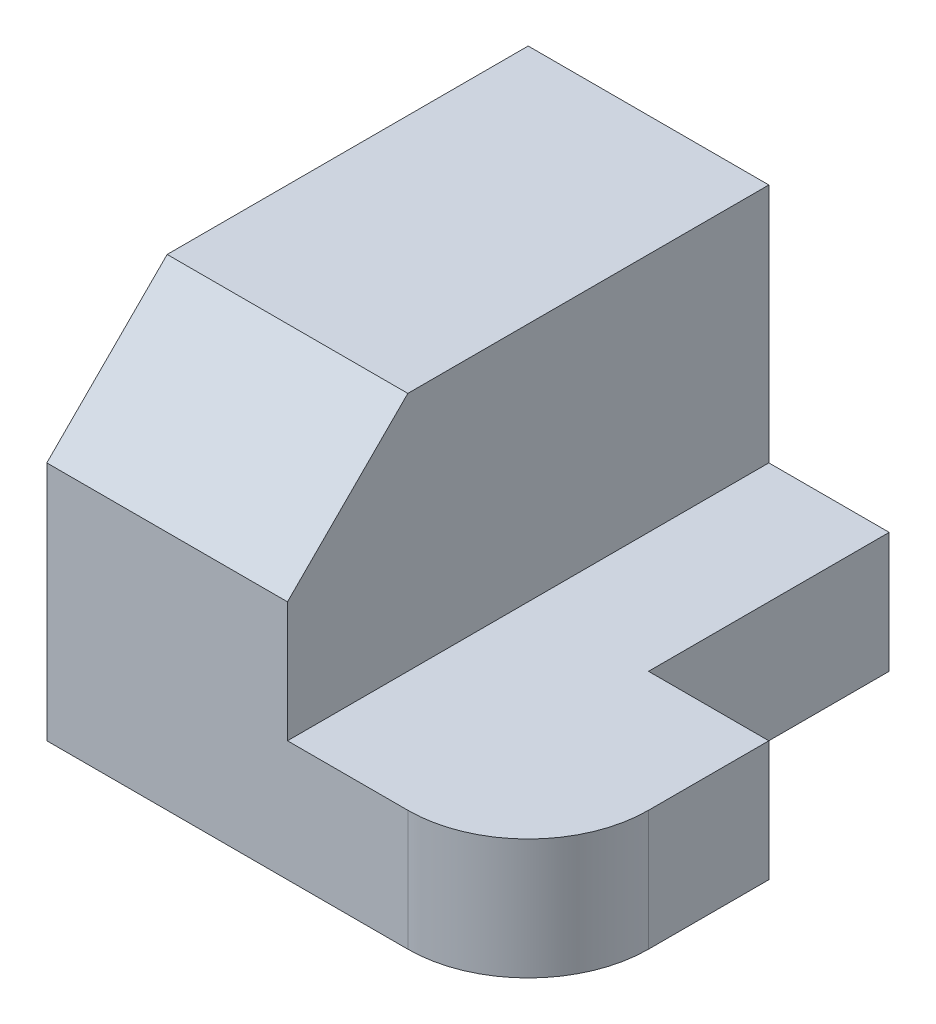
ISO-10303-21;
HEADER;
FILE_DESCRIPTION(('STEP AP214'),'2;1');
FILE_NAME('part.step','',(''),(''),'','','');
FILE_SCHEMA(('AUTOMOTIVE_DESIGN { 1 0 10303 214 1 1 1 1 }'));
ENDSEC;
DATA;
#1=APPLICATION_CONTEXT('core data for automotive mechanical design processes');
#2=APPLICATION_PROTOCOL_DEFINITION('international standard','automotive_design',2000,#1);
#3=PRODUCT_CONTEXT('',#1,'mechanical');
#4=PRODUCT('Part','Part','',(#3));
#5=PRODUCT_RELATED_PRODUCT_CATEGORY('part','',(#4));
#6=PRODUCT_DEFINITION_FORMATION('','',#4);
#7=PRODUCT_DEFINITION_CONTEXT('part definition',#1,'design');
#8=PRODUCT_DEFINITION('design','',#6,#7);
#9=PRODUCT_DEFINITION_SHAPE('','',#8);
#10=(LENGTH_UNIT() NAMED_UNIT(*) SI_UNIT(.MILLI.,.METRE.));
#11=(NAMED_UNIT(*) PLANE_ANGLE_UNIT() SI_UNIT($,.RADIAN.));
#12=(NAMED_UNIT(*) SI_UNIT($,.STERADIAN.) SOLID_ANGLE_UNIT());
#13=UNCERTAINTY_MEASURE_WITH_UNIT(LENGTH_MEASURE(1.E-05),#10,'distance_accuracy_value','');
#14=(GEOMETRIC_REPRESENTATION_CONTEXT(3) GLOBAL_UNCERTAINTY_ASSIGNED_CONTEXT((#13)) GLOBAL_UNIT_ASSIGNED_CONTEXT((#10,
#11,#12)) REPRESENTATION_CONTEXT('',''));
#15=CARTESIAN_POINT('',(0.,0.,0.));
#16=DIRECTION('',(0.,0.,1.));
#17=DIRECTION('',(1.,0.,0.));
#18=AXIS2_PLACEMENT_3D('',#15,#16,#17);
#19=CARTESIAN_POINT('',(30.,10.,0.));
#20=DIRECTION('',(0.,0.,1.));
#21=DIRECTION('',(1.,0.,0.));
#22=AXIS2_PLACEMENT_3D('',#19,#20,#21);
#23=PLANE('',#22);
#24=DIRECTION('',(-1.,0.,0.));
#25=VECTOR('',#24,1.);
#26=CARTESIAN_POINT('',(30.,0.,0.));
#27=LINE('',#26,#25);
#28=CARTESIAN_POINT('',(30.,0.,0.));
#29=VERTEX_POINT('',#28);
#30=CARTESIAN_POINT('',(0.,0.,0.));
#31=VERTEX_POINT('',#30);
#32=EDGE_CURVE('E150',#29,#31,#27,.T.);
#33=ORIENTED_EDGE('',*,*,#32,.T.);
#34=DIRECTION('',(0.,-1.,0.));
#35=VECTOR('',#34,1.);
#36=CARTESIAN_POINT('',(0.,10.,0.));
#37=LINE('',#36,#35);
#38=CARTESIAN_POINT('',(0.,30.,0.));
#39=VERTEX_POINT('',#38);
#40=EDGE_CURVE('E128',#39,#31,#37,.T.);
#41=ORIENTED_EDGE('',*,*,#40,.F.);
#42=DIRECTION('',(-1.,0.,0.));
#43=VECTOR('',#42,1.);
#44=CARTESIAN_POINT('',(0.,30.,0.));
#45=LINE('',#44,#43);
#46=CARTESIAN_POINT('',(20.,30.,0.));
#47=VERTEX_POINT('',#46);
#48=EDGE_CURVE('E110',#47,#39,#45,.T.);
#49=ORIENTED_EDGE('',*,*,#48,.F.);
#50=DIRECTION('',(0.,-1.,0.));
#51=VECTOR('',#50,1.);
#52=CARTESIAN_POINT('',(20.,30.,0.));
#53=LINE('',#52,#51);
#54=CARTESIAN_POINT('',(20.,10.,0.));
#55=VERTEX_POINT('',#54);
#56=EDGE_CURVE('E118',#47,#55,#53,.T.);
#57=ORIENTED_EDGE('',*,*,#56,.T.);
#58=DIRECTION('',(-1.,0.,0.));
#59=VECTOR('',#58,1.);
#60=CARTESIAN_POINT('',(30.,10.,0.));
#61=LINE('',#60,#59);
#62=CARTESIAN_POINT('',(30.,10.,0.));
#63=VERTEX_POINT('',#62);
#64=EDGE_CURVE('E174',#63,#55,#61,.T.);
#65=ORIENTED_EDGE('',*,*,#64,.F.);
#66=DIRECTION('',(0.,-1.,0.));
#67=VECTOR('',#66,1.);
#68=CARTESIAN_POINT('',(30.,10.,0.));
#69=LINE('',#68,#67);
#70=EDGE_CURVE('E188',#63,#29,#69,.T.);
#71=ORIENTED_EDGE('',*,*,#70,.T.);
#72=EDGE_LOOP('',(#33,#41,#49,#57,#65,#71));
#73=FACE_BOUND('',#72,.T.);
#74=ADVANCED_FACE('F30',(#73),#23,.F.);
#75=CARTESIAN_POINT('',(0.,10.,0.));
#76=DIRECTION('',(1.,0.,0.));
#77=DIRECTION('',(0.,0.,-1.));
#78=AXIS2_PLACEMENT_3D('',#75,#76,#77);
#79=PLANE('',#78);
#80=DIRECTION('',(0.,-1.,0.));
#81=VECTOR('',#80,1.);
#82=CARTESIAN_POINT('',(0.,10.,40.));
#83=LINE('',#82,#81);
#84=CARTESIAN_POINT('',(0.,19.9999999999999,40.));
#85=VERTEX_POINT('',#84);
#86=CARTESIAN_POINT('',(0.,0.,40.));
#87=VERTEX_POINT('',#86);
#88=EDGE_CURVE('E167',#85,#87,#83,.T.);
#89=ORIENTED_EDGE('',*,*,#88,.F.);
#90=DIRECTION('',(0.,-0.707106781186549,0.707106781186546));
#91=VECTOR('',#90,1.);
#92=CARTESIAN_POINT('',(0.,30.,30.));
#93=LINE('',#92,#91);
#94=CARTESIAN_POINT('',(0.,30.,30.));
#95=VERTEX_POINT('',#94);
#96=EDGE_CURVE('E11',#85,#95,#93,.F.);
#97=ORIENTED_EDGE('',*,*,#96,.T.);
#98=DIRECTION('',(0.,0.,1.));
#99=VECTOR('',#98,1.);
#100=CARTESIAN_POINT('',(0.,30.,40.));
#101=LINE('',#100,#99);
#102=EDGE_CURVE('E114',#39,#95,#101,.T.);
#103=ORIENTED_EDGE('',*,*,#102,.F.);
#104=ORIENTED_EDGE('',*,*,#40,.T.);
#105=DIRECTION('',(0.,0.,1.));
#106=VECTOR('',#105,1.);
#107=CARTESIAN_POINT('',(0.,0.,0.));
#108=LINE('',#107,#106);
#109=EDGE_CURVE('E202',#31,#87,#108,.T.);
#110=ORIENTED_EDGE('',*,*,#109,.T.);
#111=EDGE_LOOP('',(#89,#97,#103,#104,#110));
#112=FACE_BOUND('',#111,.T.);
#113=ADVANCED_FACE('F219',(#112),#79,.F.);
#114=CARTESIAN_POINT('',(0.,10.,40.));
#115=DIRECTION('',(0.,0.,-1.));
#116=DIRECTION('',(-1.,0.,0.));
#117=AXIS2_PLACEMENT_3D('',#114,#115,#116);
#118=PLANE('',#117);
#119=DIRECTION('',(0.,-1.,0.));
#120=VECTOR('',#119,1.);
#121=CARTESIAN_POINT('',(20.,30.,40.));
#122=LINE('',#121,#120);
#123=CARTESIAN_POINT('',(20.,20.,40.));
#124=VERTEX_POINT('',#123);
#125=CARTESIAN_POINT('',(20.,10.,40.));
#126=VERTEX_POINT('',#125);
#127=EDGE_CURVE('E124',#124,#126,#122,.T.);
#128=ORIENTED_EDGE('',*,*,#127,.F.);
#129=DIRECTION('',(-1.,0.,0.));
#130=VECTOR('',#129,1.);
#131=CARTESIAN_POINT('',(0.,20.,40.));
#132=LINE('',#131,#130);
#133=EDGE_CURVE('E38',#124,#85,#132,.T.);
#134=ORIENTED_EDGE('',*,*,#133,.T.);
#135=ORIENTED_EDGE('',*,*,#88,.T.);
#136=DIRECTION('',(1.,0.,0.));
#137=VECTOR('',#136,1.);
#138=CARTESIAN_POINT('',(0.,0.,40.));
#139=LINE('',#138,#137);
#140=CARTESIAN_POINT('',(30.,0.,40.));
#141=VERTEX_POINT('',#140);
#142=EDGE_CURVE('E204',#87,#141,#139,.T.);
#143=ORIENTED_EDGE('',*,*,#142,.T.);
#144=DIRECTION('',(0.,-1.,0.));
#145=VECTOR('',#144,1.);
#146=CARTESIAN_POINT('',(30.,10.,40.));
#147=LINE('',#146,#145);
#148=CARTESIAN_POINT('',(30.,10.,40.));
#149=VERTEX_POINT('',#148);
#150=EDGE_CURVE('E153',#141,#149,#147,.F.);
#151=ORIENTED_EDGE('',*,*,#150,.T.);
#152=DIRECTION('',(1.,0.,0.));
#153=VECTOR('',#152,1.);
#154=CARTESIAN_POINT('',(0.,10.,40.));
#155=LINE('',#154,#153);
#156=EDGE_CURVE('E138',#126,#149,#155,.T.);
#157=ORIENTED_EDGE('',*,*,#156,.F.);
#158=EDGE_LOOP('',(#128,#134,#135,#143,#151,#157));
#159=FACE_BOUND('',#158,.T.);
#160=ADVANCED_FACE('F211',(#159),#118,.F.);
#161=CARTESIAN_POINT('',(40.,10.,40.));
#162=DIRECTION('',(-1.,0.,0.));
#163=DIRECTION('',(0.,0.,1.));
#164=AXIS2_PLACEMENT_3D('',#161,#162,#163);
#165=PLANE('',#164);
#166=DIRECTION('',(0.,0.,-1.));
#167=VECTOR('',#166,1.);
#168=CARTESIAN_POINT('',(40.,10.,40.));
#169=LINE('',#168,#167);
#170=CARTESIAN_POINT('',(40.,10.,30.));
#171=VERTEX_POINT('',#170);
#172=CARTESIAN_POINT('',(40.,10.,20.));
#173=VERTEX_POINT('',#172);
#174=EDGE_CURVE('E176',#171,#173,#169,.T.);
#175=ORIENTED_EDGE('',*,*,#174,.F.);
#176=DIRECTION('',(0.,-1.,0.));
#177=VECTOR('',#176,1.);
#178=CARTESIAN_POINT('',(40.,10.,30.));
#179=LINE('',#178,#177);
#180=CARTESIAN_POINT('',(40.,0.,30.));
#181=VERTEX_POINT('',#180);
#182=EDGE_CURVE('E145',#171,#181,#179,.T.);
#183=ORIENTED_EDGE('',*,*,#182,.T.);
#184=DIRECTION('',(0.,0.,-1.));
#185=VECTOR('',#184,1.);
#186=CARTESIAN_POINT('',(40.,0.,40.));
#187=LINE('',#186,#185);
#188=CARTESIAN_POINT('',(40.,0.,20.));
#189=VERTEX_POINT('',#188);
#190=EDGE_CURVE('E184',#181,#189,#187,.T.);
#191=ORIENTED_EDGE('',*,*,#190,.T.);
#192=DIRECTION('',(0.,-1.,0.));
#193=VECTOR('',#192,1.);
#194=CARTESIAN_POINT('',(40.,10.,20.));
#195=LINE('',#194,#193);
#196=EDGE_CURVE('E171',#173,#189,#195,.T.);
#197=ORIENTED_EDGE('',*,*,#196,.F.);
#198=EDGE_LOOP('',(#175,#183,#191,#197));
#199=FACE_BOUND('',#198,.T.);
#200=ADVANCED_FACE('F209',(#199),#165,.F.);
#201=CARTESIAN_POINT('',(40.,10.,20.));
#202=DIRECTION('',(0.,0.,1.));
#203=DIRECTION('',(1.,0.,0.));
#204=AXIS2_PLACEMENT_3D('',#201,#202,#203);
#205=PLANE('',#204);
#206=DIRECTION('',(-1.,0.,0.));
#207=VECTOR('',#206,1.);
#208=CARTESIAN_POINT('',(40.,0.,20.));
#209=LINE('',#208,#207);
#210=CARTESIAN_POINT('',(30.,0.,20.));
#211=VERTEX_POINT('',#210);
#212=EDGE_CURVE('E177',#189,#211,#209,.T.);
#213=ORIENTED_EDGE('',*,*,#212,.T.);
#214=DIRECTION('',(0.,-1.,0.));
#215=VECTOR('',#214,1.);
#216=CARTESIAN_POINT('',(30.,10.,20.));
#217=LINE('',#216,#215);
#218=CARTESIAN_POINT('',(30.,10.,20.));
#219=VERTEX_POINT('',#218);
#220=EDGE_CURVE('E190',#219,#211,#217,.T.);
#221=ORIENTED_EDGE('',*,*,#220,.F.);
#222=DIRECTION('',(-1.,0.,0.));
#223=VECTOR('',#222,1.);
#224=CARTESIAN_POINT('',(40.,10.,20.));
#225=LINE('',#224,#223);
#226=EDGE_CURVE('E199',#173,#219,#225,.T.);
#227=ORIENTED_EDGE('',*,*,#226,.F.);
#228=ORIENTED_EDGE('',*,*,#196,.T.);
#229=EDGE_LOOP('',(#213,#221,#227,#228));
#230=FACE_BOUND('',#229,.T.);
#231=ADVANCED_FACE('F197',(#230),#205,.F.);
#232=CARTESIAN_POINT('',(30.,10.,20.));
#233=DIRECTION('',(-1.,0.,0.));
#234=DIRECTION('',(0.,0.,1.));
#235=AXIS2_PLACEMENT_3D('',#232,#233,#234);
#236=PLANE('',#235);
#237=DIRECTION('',(0.,0.,-1.));
#238=VECTOR('',#237,1.);
#239=CARTESIAN_POINT('',(30.,0.,20.));
#240=LINE('',#239,#238);
#241=EDGE_CURVE('E175',#211,#29,#240,.T.);
#242=ORIENTED_EDGE('',*,*,#241,.T.);
#243=ORIENTED_EDGE('',*,*,#70,.F.);
#244=DIRECTION('',(0.,0.,-1.));
#245=VECTOR('',#244,1.);
#246=CARTESIAN_POINT('',(30.,10.,20.));
#247=LINE('',#246,#245);
#248=EDGE_CURVE('E191',#219,#63,#247,.T.);
#249=ORIENTED_EDGE('',*,*,#248,.F.);
#250=ORIENTED_EDGE('',*,*,#220,.T.);
#251=EDGE_LOOP('',(#242,#243,#249,#250));
#252=FACE_BOUND('',#251,.T.);
#253=ADVANCED_FACE('F217',(#252),#236,.F.);
#254=CARTESIAN_POINT('',(0.,10.,0.));
#255=DIRECTION('',(0.,1.,0.));
#256=DIRECTION('',(0.,0.,1.));
#257=AXIS2_PLACEMENT_3D('',#254,#255,#256);
#258=PLANE('',#257);
#259=ORIENTED_EDGE('',*,*,#156,.T.);
#260=CARTESIAN_POINT('',(30.,10.,30.));
#261=DIRECTION('',(0.,1.,0.));
#262=DIRECTION('',(0.,0.,1.));
#263=AXIS2_PLACEMENT_3D('',#260,#261,#262);
#264=CIRCLE('',#263,10.);
#265=EDGE_CURVE('E152',#149,#171,#264,.T.);
#266=ORIENTED_EDGE('',*,*,#265,.T.);
#267=ORIENTED_EDGE('',*,*,#174,.T.);
#268=ORIENTED_EDGE('',*,*,#226,.T.);
#269=ORIENTED_EDGE('',*,*,#248,.T.);
#270=ORIENTED_EDGE('',*,*,#64,.T.);
#271=DIRECTION('',(0.,0.,-1.));
#272=VECTOR('',#271,1.);
#273=CARTESIAN_POINT('',(20.,10.,40.));
#274=LINE('',#273,#272);
#275=EDGE_CURVE('E121',#126,#55,#274,.T.);
#276=ORIENTED_EDGE('',*,*,#275,.F.);
#277=EDGE_LOOP('',(#259,#266,#267,#268,#269,#270,#276));
#278=FACE_BOUND('',#277,.T.);
#279=ADVANCED_FACE('F238',(#278),#258,.T.);
#280=CARTESIAN_POINT('',(0.,0.,0.));
#281=DIRECTION('',(0.,1.,0.));
#282=DIRECTION('',(0.,0.,1.));
#283=AXIS2_PLACEMENT_3D('',#280,#281,#282);
#284=PLANE('',#283);
#285=ORIENTED_EDGE('',*,*,#190,.F.);
#286=CARTESIAN_POINT('',(30.,0.,30.));
#287=DIRECTION('',(0.,1.,0.));
#288=DIRECTION('',(0.,0.,1.));
#289=AXIS2_PLACEMENT_3D('',#286,#287,#288);
#290=CIRCLE('',#289,10.);
#291=EDGE_CURVE('E158',#181,#141,#290,.F.);
#292=ORIENTED_EDGE('',*,*,#291,.T.);
#293=ORIENTED_EDGE('',*,*,#142,.F.);
#294=ORIENTED_EDGE('',*,*,#109,.F.);
#295=ORIENTED_EDGE('',*,*,#32,.F.);
#296=ORIENTED_EDGE('',*,*,#241,.F.);
#297=ORIENTED_EDGE('',*,*,#212,.F.);
#298=EDGE_LOOP('',(#285,#292,#293,#294,#295,#296,#297));
#299=FACE_BOUND('',#298,.T.);
#300=ADVANCED_FACE('F200',(#299),#284,.F.);
#301=CARTESIAN_POINT('',(20.,30.,40.));
#302=DIRECTION('',(-1.,0.,0.));
#303=DIRECTION('',(0.,0.,1.));
#304=AXIS2_PLACEMENT_3D('',#301,#302,#303);
#305=PLANE('',#304);
#306=DIRECTION('',(0.,0.,-1.));
#307=VECTOR('',#306,1.);
#308=CARTESIAN_POINT('',(20.,30.,40.));
#309=LINE('',#308,#307);
#310=CARTESIAN_POINT('',(20.,30.,30.));
#311=VERTEX_POINT('',#310);
#312=EDGE_CURVE('E105',#311,#47,#309,.T.);
#313=ORIENTED_EDGE('',*,*,#312,.F.);
#314=DIRECTION('',(0.,0.707106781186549,-0.707106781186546));
#315=VECTOR('',#314,1.);
#316=CARTESIAN_POINT('',(20.,30.,30.));
#317=LINE('',#316,#315);
#318=EDGE_CURVE('E52',#311,#124,#317,.F.);
#319=ORIENTED_EDGE('',*,*,#318,.T.);
#320=ORIENTED_EDGE('',*,*,#127,.T.);
#321=ORIENTED_EDGE('',*,*,#275,.T.);
#322=ORIENTED_EDGE('',*,*,#56,.F.);
#323=EDGE_LOOP('',(#313,#319,#320,#321,#322));
#324=FACE_BOUND('',#323,.T.);
#325=ADVANCED_FACE('F119',(#324),#305,.F.);
#326=CARTESIAN_POINT('',(0.,30.,0.));
#327=DIRECTION('',(0.,-1.,0.));
#328=DIRECTION('',(0.,0.,-1.));
#329=AXIS2_PLACEMENT_3D('',#326,#327,#328);
#330=PLANE('',#329);
#331=ORIENTED_EDGE('',*,*,#102,.T.);
#332=DIRECTION('',(1.,0.,0.));
#333=VECTOR('',#332,1.);
#334=CARTESIAN_POINT('',(0.,30.,30.));
#335=LINE('',#334,#333);
#336=EDGE_CURVE('E113',#95,#311,#335,.T.);
#337=ORIENTED_EDGE('',*,*,#336,.T.);
#338=ORIENTED_EDGE('',*,*,#312,.T.);
#339=ORIENTED_EDGE('',*,*,#48,.T.);
#340=EDGE_LOOP('',(#331,#337,#338,#339));
#341=FACE_BOUND('',#340,.T.);
#342=ADVANCED_FACE('F108',(#341),#330,.F.);
#343=CARTESIAN_POINT('',(30.,10.,30.));
#344=DIRECTION('',(0.,-1.,0.));
#345=DIRECTION('',(0.,0.,-1.));
#346=AXIS2_PLACEMENT_3D('',#343,#344,#345);
#347=CYLINDRICAL_SURFACE('',#346,10.);
#348=ORIENTED_EDGE('',*,*,#265,.F.);
#349=ORIENTED_EDGE('',*,*,#150,.F.);
#350=ORIENTED_EDGE('',*,*,#291,.F.);
#351=ORIENTED_EDGE('',*,*,#182,.F.);
#352=EDGE_LOOP('',(#348,#349,#350,#351));
#353=FACE_BOUND('',#352,.T.);
#354=ADVANCED_FACE('F227',(#353),#347,.T.);
#355=CARTESIAN_POINT('',(0.,30.,30.));
#356=DIRECTION('',(0.,-0.707106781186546,-0.707106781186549));
#357=DIRECTION('',(0.,0.707106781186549,-0.707106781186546));
#358=AXIS2_PLACEMENT_3D('',#355,#356,#357);
#359=PLANE('',#358);
#360=ORIENTED_EDGE('',*,*,#96,.F.);
#361=ORIENTED_EDGE('',*,*,#133,.F.);
#362=ORIENTED_EDGE('',*,*,#318,.F.);
#363=ORIENTED_EDGE('',*,*,#336,.F.);
#364=EDGE_LOOP('',(#360,#361,#362,#363));
#365=FACE_BOUND('',#364,.T.);
#366=ADVANCED_FACE('F32',(#365),#359,.F.);
#367=CLOSED_SHELL('',(#74,#113,#160,#200,#231,#253,#279,#300,#325,#342,#354,#366));
#368=MANIFOLD_SOLID_BREP('B2',#367);
#369=ADVANCED_BREP_SHAPE_REPRESENTATION('',(#18,#368),#14);
#370=SHAPE_DEFINITION_REPRESENTATION(#9,#369);
ENDSEC;
END-ISO-10303-21;
